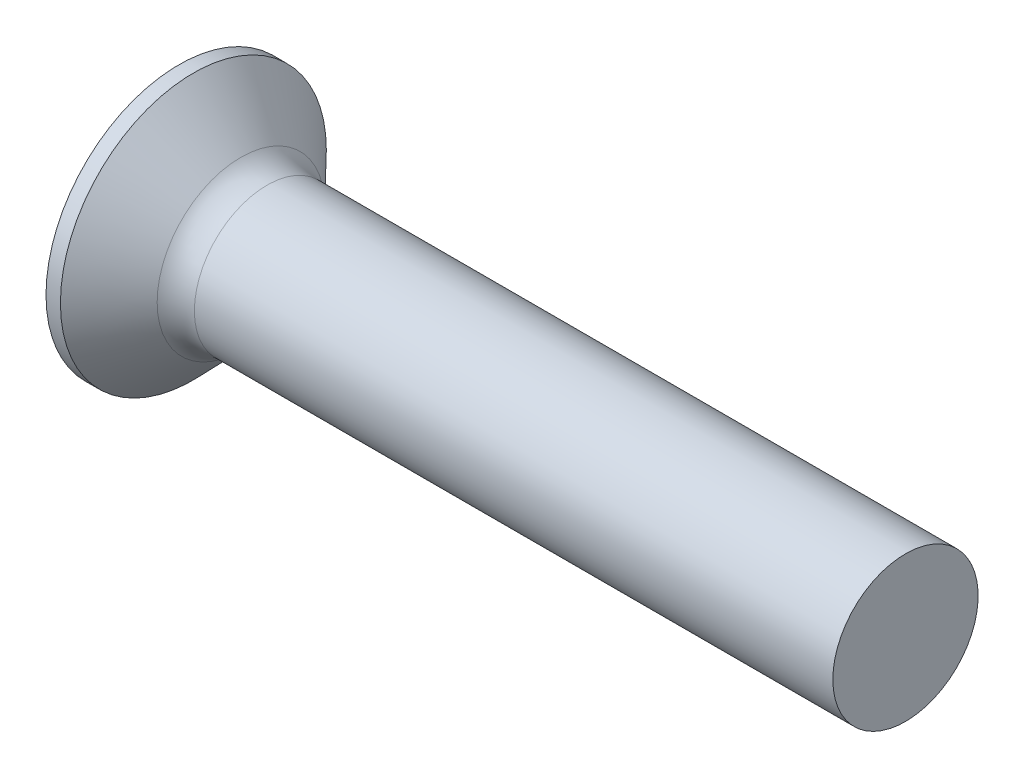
ISO-10303-21;
HEADER;
FILE_DESCRIPTION(('STEP AP214'),'2;1');
FILE_NAME('part.step','',(''),(''),'','','');
FILE_SCHEMA(('AUTOMOTIVE_DESIGN { 1 0 10303 214 1 1 1 1 }'));
ENDSEC;
DATA;
#1=APPLICATION_CONTEXT('core data for automotive mechanical design processes');
#2=APPLICATION_PROTOCOL_DEFINITION('international standard','automotive_design',2000,#1);
#3=PRODUCT_CONTEXT('',#1,'mechanical');
#4=PRODUCT('Part','Part','',(#3));
#5=PRODUCT_RELATED_PRODUCT_CATEGORY('part','',(#4));
#6=PRODUCT_DEFINITION_FORMATION('','',#4);
#7=PRODUCT_DEFINITION_CONTEXT('part definition',#1,'design');
#8=PRODUCT_DEFINITION('design','',#6,#7);
#9=PRODUCT_DEFINITION_SHAPE('','',#8);
#10=(LENGTH_UNIT() NAMED_UNIT(*) SI_UNIT(.MILLI.,.METRE.));
#11=(NAMED_UNIT(*) PLANE_ANGLE_UNIT() SI_UNIT($,.RADIAN.));
#12=(NAMED_UNIT(*) SI_UNIT($,.STERADIAN.) SOLID_ANGLE_UNIT());
#13=UNCERTAINTY_MEASURE_WITH_UNIT(LENGTH_MEASURE(1.E-05),#10,'distance_accuracy_value','');
#14=(GEOMETRIC_REPRESENTATION_CONTEXT(3) GLOBAL_UNCERTAINTY_ASSIGNED_CONTEXT((#13)) GLOBAL_UNIT_ASSIGNED_CONTEXT((#10,
#11,#12)) REPRESENTATION_CONTEXT('',''));
#15=CARTESIAN_POINT('',(0.,0.,0.));
#16=DIRECTION('',(0.,0.,1.));
#17=DIRECTION('',(1.,0.,0.));
#18=AXIS2_PLACEMENT_3D('',#15,#16,#17);
#19=CARTESIAN_POINT('',(19.3505434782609,0.,0.));
#20=DIRECTION('',(-1.,0.,0.));
#21=DIRECTION('',(0.,-1.,0.));
#22=AXIS2_PLACEMENT_3D('',#19,#20,#21);
#23=SPHERICAL_SURFACE('',#22,19.3505434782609);
#24=CARTESIAN_POINT('',(2.3,0.,0.));
#25=DIRECTION('',(-1.,0.,0.));
#26=DIRECTION('',(0.,0.,1.));
#27=AXIS2_PLACEMENT_3D('',#24,#25,#26);
#28=CIRCLE('',#27,9.15);
#29=CARTESIAN_POINT('',(2.3,0.,9.15));
#30=VERTEX_POINT('',#29);
#31=EDGE_CURVE('E212',#30,#30,#28,.T.);
#32=ORIENTED_EDGE('',*,*,#31,.T.);
#33=EDGE_LOOP('',(#32));
#34=FACE_BOUND('',#33,.T.);
#35=CARTESIAN_POINT('',(19.3505434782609,1.08,0.));
#36=DIRECTION('',(0.,-1.,0.));
#37=DIRECTION('',(0.,0.,-1.));
#38=AXIS2_PLACEMENT_3D('',#35,#36,#37);
#39=CIRCLE('',#38,19.3203812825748);
#40=CARTESIAN_POINT('',(0.643432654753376,1.08000000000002,-4.82919636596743));
#41=VERTEX_POINT('',#40);
#42=CARTESIAN_POINT('',(0.142443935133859,1.08000000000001,-2.07991462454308));
#43=VERTEX_POINT('',#42);
#44=EDGE_CURVE('E293',#41,#43,#39,.F.);
#45=ORIENTED_EDGE('',*,*,#44,.T.);
#46=CARTESIAN_POINT('',(0.142443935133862,0.,0.));
#47=DIRECTION('',(1.,0.,0.));
#48=DIRECTION('',(0.,0.,-1.));
#49=AXIS2_PLACEMENT_3D('',#46,#47,#48);
#50=CIRCLE('',#49,2.34359656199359);
#51=CARTESIAN_POINT('',(0.142443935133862,2.07991462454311,-1.08));
#52=VERTEX_POINT('',#51);
#53=EDGE_CURVE('E322',#43,#52,#50,.T.);
#54=ORIENTED_EDGE('',*,*,#53,.T.);
#55=CARTESIAN_POINT('',(19.3505434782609,0.,-1.08));
#56=DIRECTION('',(0.,0.,1.));
#57=DIRECTION('',(0.,-1.,0.));
#58=AXIS2_PLACEMENT_3D('',#55,#56,#57);
#59=CIRCLE('',#58,19.3203812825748);
#60=CARTESIAN_POINT('',(0.643432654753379,4.82919636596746,-1.08));
#61=VERTEX_POINT('',#60);
#62=EDGE_CURVE('E234',#52,#61,#59,.F.);
#63=ORIENTED_EDGE('',*,*,#62,.T.);
#64=CARTESIAN_POINT('',(17.5544828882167,-3.60234084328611,0.));
#65=DIRECTION('',(0.446197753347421,0.89493439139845,0.));
#66=DIRECTION('',(-0.89493439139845,0.446197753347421,0.));
#67=AXIS2_PLACEMENT_3D('',#64,#65,#66);
#68=CIRCLE('',#67,18.9272512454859);
#69=CARTESIAN_POINT('',(0.643432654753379,4.82919636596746,1.08));
#70=VERTEX_POINT('',#69);
#71=EDGE_CURVE('E238',#70,#61,#68,.F.);
#72=ORIENTED_EDGE('',*,*,#71,.F.);
#73=CARTESIAN_POINT('',(19.3505434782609,0.,1.08));
#74=DIRECTION('',(0.,0.,-1.));
#75=DIRECTION('',(0.,1.,0.));
#76=AXIS2_PLACEMENT_3D('',#73,#74,#75);
#77=CIRCLE('',#76,19.3203812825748);
#78=CARTESIAN_POINT('',(0.142443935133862,2.07991462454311,1.08));
#79=VERTEX_POINT('',#78);
#80=EDGE_CURVE('E231',#70,#79,#77,.F.);
#81=ORIENTED_EDGE('',*,*,#80,.T.);
#82=CARTESIAN_POINT('',(0.142443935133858,1.07999999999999,2.07991462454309));
#83=VERTEX_POINT('',#82);
#84=EDGE_CURVE('E348',#79,#83,#50,.T.);
#85=ORIENTED_EDGE('',*,*,#84,.T.);
#86=CARTESIAN_POINT('',(0.643432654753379,1.07999999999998,4.82919636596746));
#87=VERTEX_POINT('',#86);
#88=EDGE_CURVE('E259',#83,#87,#39,.F.);
#89=ORIENTED_EDGE('',*,*,#88,.T.);
#90=CARTESIAN_POINT('',(17.5544828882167,0.,-3.60234084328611));
#91=DIRECTION('',(0.446197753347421,0.,0.89493439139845));
#92=DIRECTION('',(0.89493439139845,0.,-0.446197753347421));
#93=AXIS2_PLACEMENT_3D('',#90,#91,#92);
#94=CIRCLE('',#93,18.9272512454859);
#95=CARTESIAN_POINT('',(0.643432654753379,-1.08000000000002,4.82919636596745));
#96=VERTEX_POINT('',#95);
#97=EDGE_CURVE('E55',#96,#87,#94,.F.);
#98=ORIENTED_EDGE('',*,*,#97,.F.);
#99=CARTESIAN_POINT('',(19.3505434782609,-1.08,0.));
#100=DIRECTION('',(0.,1.,0.));
#101=DIRECTION('',(0.,0.,1.));
#102=AXIS2_PLACEMENT_3D('',#99,#100,#101);
#103=CIRCLE('',#102,19.3203812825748);
#104=CARTESIAN_POINT('',(0.142443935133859,-1.08000000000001,2.07991462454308));
#105=VERTEX_POINT('',#104);
#106=EDGE_CURVE('E262',#96,#105,#103,.F.);
#107=ORIENTED_EDGE('',*,*,#106,.T.);
#108=CARTESIAN_POINT('',(0.142443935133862,-2.07991462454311,1.08));
#109=VERTEX_POINT('',#108);
#110=EDGE_CURVE('E383',#105,#109,#50,.T.);
#111=ORIENTED_EDGE('',*,*,#110,.T.);
#112=CARTESIAN_POINT('',(0.643432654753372,-4.82919636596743,1.08));
#113=VERTEX_POINT('',#112);
#114=EDGE_CURVE('E230',#109,#113,#77,.F.);
#115=ORIENTED_EDGE('',*,*,#114,.T.);
#116=CARTESIAN_POINT('',(17.5544828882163,3.60234084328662,0.));
#117=DIRECTION('',(0.44619775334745,-0.894934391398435,0.));
#118=DIRECTION('',(0.894934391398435,0.44619775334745,0.));
#119=AXIS2_PLACEMENT_3D('',#116,#117,#118);
#120=CIRCLE('',#119,18.9272512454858);
#121=CARTESIAN_POINT('',(0.643432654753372,-4.82919636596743,-1.08));
#122=VERTEX_POINT('',#121);
#123=EDGE_CURVE('E228',#122,#113,#120,.F.);
#124=ORIENTED_EDGE('',*,*,#123,.F.);
#125=CARTESIAN_POINT('',(0.142443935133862,-2.07991462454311,-1.08));
#126=VERTEX_POINT('',#125);
#127=EDGE_CURVE('E235',#122,#126,#59,.F.);
#128=ORIENTED_EDGE('',*,*,#127,.T.);
#129=CARTESIAN_POINT('',(0.142443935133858,-1.07999999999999,-2.07991462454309));
#130=VERTEX_POINT('',#129);
#131=EDGE_CURVE('E343',#126,#130,#50,.T.);
#132=ORIENTED_EDGE('',*,*,#131,.T.);
#133=CARTESIAN_POINT('',(0.643432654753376,-1.07999999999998,-4.82919636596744));
#134=VERTEX_POINT('',#133);
#135=EDGE_CURVE('E264',#130,#134,#103,.F.);
#136=ORIENTED_EDGE('',*,*,#135,.T.);
#137=CARTESIAN_POINT('',(17.5544828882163,0.,3.60234084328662));
#138=DIRECTION('',(0.44619775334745,0.,-0.894934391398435));
#139=DIRECTION('',(-0.894934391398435,0.,-0.44619775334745));
#140=AXIS2_PLACEMENT_3D('',#137,#138,#139);
#141=CIRCLE('',#140,18.9272512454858);
#142=EDGE_CURVE('E241',#41,#134,#141,.F.);
#143=ORIENTED_EDGE('',*,*,#142,.F.);
#144=EDGE_LOOP('',(#45,#54,#63,#72,#81,#85,#89,#98,#107,#111,#115,#124,#128,#132,#136,#143));
#145=FACE_BOUND('',#144,.T.);
#146=ADVANCED_FACE('F41',(#34,#145),#23,.T.);
#147=CARTESIAN_POINT('',(0.,5.15,-1.08));
#148=DIRECTION('',(0.,0.,1.));
#149=DIRECTION('',(0.,-1.,0.));
#150=AXIS2_PLACEMENT_3D('',#147,#148,#149);
#151=PLANE('',#150);
#152=ORIENTED_EDGE('',*,*,#62,.F.);
#153=CARTESIAN_POINT('',(-3.44355605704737,2.35887117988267,-1.08));
#154=CARTESIAN_POINT('',(-2.7304906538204,2.30401999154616,-1.08));
#155=CARTESIAN_POINT('',(-2.01744868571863,2.24886012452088,-1.08));
#156=CARTESIAN_POINT('',(-0.591414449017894,2.13771480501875,-1.08));
#157=CARTESIAN_POINT('',(0.121577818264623,2.08172933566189,-1.08));
#158=CARTESIAN_POINT('',(1.19100520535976,1.99697742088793,-1.08));
#159=CARTESIAN_POINT('',(1.54747097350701,1.96859781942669,-1.08));
#160=CARTESIAN_POINT('',(2.26037773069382,1.9115430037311,-1.08));
#161=CARTESIAN_POINT('',(2.61681871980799,1.88286779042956,-1.08));
#162=CARTESIAN_POINT('',(3.32966606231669,1.82518005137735,-1.08));
#163=CARTESIAN_POINT('',(3.68607241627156,1.79616753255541,-1.08));
#164=CARTESIAN_POINT('',(4.39885706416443,1.73775165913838,-1.08));
#165=CARTESIAN_POINT('',(4.75523535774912,1.70834830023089,-1.08));
#166=CARTESIAN_POINT('',(5.58663589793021,1.63921941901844,-1.08));
#167=CARTESIAN_POINT('',(6.0616435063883,1.59931748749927,-1.08));
#168=CARTESIAN_POINT('',(7.01157125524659,1.5185088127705,-1.08));
#169=CARTESIAN_POINT('',(7.48649139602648,1.47760207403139,-1.08));
#170=CARTESIAN_POINT('',(8.43619415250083,1.39450876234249,-1.08));
#171=CARTESIAN_POINT('',(8.91097677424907,1.35232225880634,-1.08));
#172=CARTESIAN_POINT('',(9.86039820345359,1.26626057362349,-1.08));
#173=CARTESIAN_POINT('',(10.335037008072,1.2223853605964,-1.08));
#174=CARTESIAN_POINT('',(11.2842082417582,1.13232451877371,-1.08));
#175=CARTESIAN_POINT('',(11.7587406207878,1.0861383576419,-1.08));
#176=CARTESIAN_POINT('',(12.4702723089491,1.01434051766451,-1.08));
#177=CARTESIAN_POINT('',(12.707398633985,0.989988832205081,-1.08));
#178=CARTESIAN_POINT('',(13.1815436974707,0.940232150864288,-1.08));
#179=CARTESIAN_POINT('',(13.4185624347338,0.914827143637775,-1.08));
#180=CARTESIAN_POINT('',(13.8925107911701,0.862671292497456,-1.08));
#181=CARTESIAN_POINT('',(14.1294403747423,0.835920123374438,-1.08));
#182=CARTESIAN_POINT('',(14.6030864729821,0.78064491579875,-1.08));
#183=CARTESIAN_POINT('',(14.8398029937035,0.752120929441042,-1.08));
#184=CARTESIAN_POINT('',(15.3129751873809,0.692614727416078,-1.08));
#185=CARTESIAN_POINT('',(15.5494308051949,0.661632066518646,-1.08));
#186=CARTESIAN_POINT('',(15.903743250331,0.612390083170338,-1.08));
#187=CARTESIAN_POINT('',(16.0217913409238,0.595513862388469,-1.08));
#188=CARTESIAN_POINT('',(16.2577108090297,0.560543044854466,-1.08));
#189=CARTESIAN_POINT('',(16.3755821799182,0.54244840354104,-1.08));
#190=CARTESIAN_POINT('',(16.4933362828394,0.523597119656,-1.08));
#191=B_SPLINE_CURVE_WITH_KNOTS('',3,(#153,#154,#155,#156,#157,#158,#159,#160,#161,#162,#163,
#164,#165,#166,#167,#168,#169,#170,#171,#172,#173,#174,#175,#176,#177,#178,#179,#180,#181,#182,
#183,#184,#185,#186,#187,#188,#189,#190),.UNSPECIFIED.,.F.,.F.,(4,2,2,2,2,2,2,2,2,2,2,2,2,2,2,2,
2,2,4),(0.,2.14551628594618,4.29107649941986,5.36385745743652,6.43663503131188,7.50939060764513,
8.58215803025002,10.0121989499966,11.44223350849,12.8721906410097,14.302174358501,
15.7324890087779,16.4476075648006,17.1627338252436,17.8780336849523,18.59331253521,
19.3087212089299,19.6664605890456,20.0242130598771),.UNSPECIFIED.);
#192=CARTESIAN_POINT('',(6.05,1.60013444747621,-1.08));
#193=VERTEX_POINT('',#192);
#194=EDGE_CURVE('E370',#52,#193,#191,.T.);
#195=ORIENTED_EDGE('',*,*,#194,.T.);
#196=DIRECTION('',(0.,1.,0.));
#197=VECTOR('',#196,1.);
#198=CARTESIAN_POINT('',(6.05,-2.13358177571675,-1.08));
#199=LINE('',#198,#197);
#200=CARTESIAN_POINT('',(6.05,2.133581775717,-1.08));
#201=VERTEX_POINT('',#200);
#202=EDGE_CURVE('E313',#193,#201,#199,.T.);
#203=ORIENTED_EDGE('',*,*,#202,.T.);
#204=DIRECTION('',(0.89493439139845,-0.446197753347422,0.));
#205=VECTOR('',#204,1.);
#206=CARTESIAN_POINT('',(0.,5.15,-1.08));
#207=LINE('',#206,#205);
#208=EDGE_CURVE('E209',#61,#201,#207,.T.);
#209=ORIENTED_EDGE('',*,*,#208,.F.);
#210=EDGE_LOOP('',(#152,#195,#203,#209));
#211=FACE_BOUND('',#210,.T.);
#212=ADVANCED_FACE('F176',(#211),#151,.T.);
#213=CARTESIAN_POINT('',(6.05,-2.13358177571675,-1.08));
#214=VERTEX_POINT('',#213);
#215=CARTESIAN_POINT('',(6.05,-1.60013444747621,-1.08));
#216=VERTEX_POINT('',#215);
#217=EDGE_CURVE('E218',#214,#216,#199,.T.);
#218=ORIENTED_EDGE('',*,*,#217,.T.);
#219=CARTESIAN_POINT('',(-3.44355604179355,-2.35887117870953,-1.08));
#220=CARTESIAN_POINT('',(-2.73049064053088,-2.30401999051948,-1.08));
#221=CARTESIAN_POINT('',(-2.01744867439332,-2.24886012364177,-1.08));
#222=CARTESIAN_POINT('',(-0.591414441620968,-2.13771480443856,-1.08));
#223=CARTESIAN_POINT('',(0.121577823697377,-2.08172933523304,-1.08));
#224=CARTESIAN_POINT('',(1.19100520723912,-1.99697742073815,-1.08));
#225=CARTESIAN_POINT('',(1.54747097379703,-1.96859781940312,-1.08));
#226=CARTESIAN_POINT('',(2.26037772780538,-1.91154300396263,-1.08));
#227=CARTESIAN_POINT('',(2.61681871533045,-1.88286779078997,-1.08));
#228=CARTESIAN_POINT('',(3.32966605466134,-1.8251800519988,-1.08));
#229=CARTESIAN_POINT('',(3.6860724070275,-1.79616753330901,-1.08));
#230=CARTESIAN_POINT('',(4.39885705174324,-1.73775166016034,-1.08));
#231=CARTESIAN_POINT('',(4.7552353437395,-1.70834830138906,-1.08));
#232=CARTESIAN_POINT('',(5.58663588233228,-1.63921942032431,-1.08));
#233=CARTESIAN_POINT('',(6.06164349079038,-1.59931748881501,-1.08));
#234=CARTESIAN_POINT('',(7.01157123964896,-1.51850881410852,-1.08));
#235=CARTESIAN_POINT('',(7.48649138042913,-1.47760207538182,-1.08));
#236=CARTESIAN_POINT('',(8.43619413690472,-1.39450876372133,-1.08));
#237=CARTESIAN_POINT('',(8.91097675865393,-1.35232226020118,-1.08));
#238=CARTESIAN_POINT('',(9.86039818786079,-1.26626057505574,-1.08));
#239=CARTESIAN_POINT('',(10.3350369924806,-1.22238536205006,-1.08));
#240=CARTESIAN_POINT('',(11.2842082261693,-1.13232452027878,-1.08));
#241=CARTESIAN_POINT('',(11.7587406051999,-1.08613835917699,-1.08));
#242=CARTESIAN_POINT('',(12.4702722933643,-1.01434051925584,-1.08));
#243=CARTESIAN_POINT('',(12.7073986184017,-0.989988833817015,-1.08));
#244=CARTESIAN_POINT('',(13.1815436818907,-0.940232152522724,-1.08));
#245=CARTESIAN_POINT('',(13.4185624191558,-0.914827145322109,-1.08));
#246=CARTESIAN_POINT('',(13.8925107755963,-0.862671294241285,-1.08));
#247=CARTESIAN_POINT('',(14.1294403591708,-0.83592012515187,-1.08));
#248=CARTESIAN_POINT('',(14.6030864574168,-0.780644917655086,-1.08));
#249=CARTESIAN_POINT('',(14.8398029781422,-0.752120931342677,-1.08));
#250=CARTESIAN_POINT('',(15.3129751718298,-0.692614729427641,-1.08));
#251=CARTESIAN_POINT('',(15.54943078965,-0.661632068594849,-1.08));
#252=CARTESIAN_POINT('',(15.9037432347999,-0.612390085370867,-1.08));
#253=CARTESIAN_POINT('',(16.021791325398,-0.595513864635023,-1.08));
#254=CARTESIAN_POINT('',(16.2577107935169,-0.56054304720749,-1.08));
#255=CARTESIAN_POINT('',(16.3755821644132,-0.542448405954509,-1.08));
#256=CARTESIAN_POINT('',(16.4933362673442,-0.523597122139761,-1.08));
#257=B_SPLINE_CURVE_WITH_KNOTS('',3,(#219,#220,#221,#222,#223,#224,#225,#226,#227,#228,#229,
#230,#231,#232,#233,#234,#235,#236,#237,#238,#239,#240,#241,#242,#243,#244,#245,#246,#247,#248,
#249,#250,#251,#252,#253,#254,#255,#256),.UNSPECIFIED.,.F.,.F.,(4,2,2,2,2,2,2,2,2,2,2,2,2,2,2,2,
2,2,4),(0.,2.14551628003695,4.29107648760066,5.36385744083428,6.43663500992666,7.50939058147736,
8.58215799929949,10.0121989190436,11.4422334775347,12.872190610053,14.3021743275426,
15.732488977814,16.4476075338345,17.1627337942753,17.8780336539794,18.5933125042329,
19.3087211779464,19.6664605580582,20.0242130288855),.UNSPECIFIED.);
#258=EDGE_CURVE('E347',#216,#126,#257,.F.);
#259=ORIENTED_EDGE('',*,*,#258,.T.);
#260=ORIENTED_EDGE('',*,*,#127,.F.);
#261=DIRECTION('',(0.894934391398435,0.44619775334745,0.));
#262=VECTOR('',#261,1.);
#263=CARTESIAN_POINT('',(0.,-5.15,-1.08));
#264=LINE('',#263,#262);
#265=EDGE_CURVE('E70',#122,#214,#264,.T.);
#266=ORIENTED_EDGE('',*,*,#265,.T.);
#267=EDGE_LOOP('',(#218,#259,#260,#266));
#268=FACE_BOUND('',#267,.T.);
#269=ADVANCED_FACE('F183',(#268),#151,.T.);
#270=CARTESIAN_POINT('',(0.,-5.15,1.08));
#271=DIRECTION('',(0.,0.,-1.));
#272=DIRECTION('',(0.,1.,0.));
#273=AXIS2_PLACEMENT_3D('',#270,#271,#272);
#274=PLANE('',#273);
#275=DIRECTION('',(0.,-1.,0.));
#276=VECTOR('',#275,1.);
#277=CARTESIAN_POINT('',(6.05,2.133581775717,1.08));
#278=LINE('',#277,#276);
#279=CARTESIAN_POINT('',(6.05,2.133581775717,1.08));
#280=VERTEX_POINT('',#279);
#281=CARTESIAN_POINT('',(6.05,1.60013444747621,1.08));
#282=VERTEX_POINT('',#281);
#283=EDGE_CURVE('E303',#280,#282,#278,.T.);
#284=ORIENTED_EDGE('',*,*,#283,.T.);
#285=CARTESIAN_POINT('',(-3.44355604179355,2.35887117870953,1.08));
#286=CARTESIAN_POINT('',(-2.73049064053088,2.30401999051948,1.08));
#287=CARTESIAN_POINT('',(-2.01744867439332,2.24886012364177,1.08));
#288=CARTESIAN_POINT('',(-0.591414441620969,2.13771480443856,1.08));
#289=CARTESIAN_POINT('',(0.121577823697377,2.08172933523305,1.08));
#290=CARTESIAN_POINT('',(1.19100520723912,1.99697742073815,1.08));
#291=CARTESIAN_POINT('',(1.54747097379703,1.96859781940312,1.08));
#292=CARTESIAN_POINT('',(2.26037772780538,1.91154300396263,1.08));
#293=CARTESIAN_POINT('',(2.61681871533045,1.88286779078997,1.08));
#294=CARTESIAN_POINT('',(3.32966605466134,1.8251800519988,1.08));
#295=CARTESIAN_POINT('',(3.6860724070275,1.79616753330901,1.08));
#296=CARTESIAN_POINT('',(4.39885705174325,1.73775166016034,1.08));
#297=CARTESIAN_POINT('',(4.7552353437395,1.70834830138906,1.08));
#298=CARTESIAN_POINT('',(5.58663588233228,1.63921942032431,1.08));
#299=CARTESIAN_POINT('',(6.06164349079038,1.59931748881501,1.08));
#300=CARTESIAN_POINT('',(7.01157123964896,1.51850881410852,1.08));
#301=CARTESIAN_POINT('',(7.48649138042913,1.47760207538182,1.08));
#302=CARTESIAN_POINT('',(8.43619413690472,1.39450876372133,1.08));
#303=CARTESIAN_POINT('',(8.91097675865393,1.35232226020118,1.08));
#304=CARTESIAN_POINT('',(9.86039818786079,1.26626057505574,1.08));
#305=CARTESIAN_POINT('',(10.3350369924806,1.22238536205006,1.08));
#306=CARTESIAN_POINT('',(11.2842082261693,1.13232452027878,1.08));
#307=CARTESIAN_POINT('',(11.7587406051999,1.08613835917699,1.08));
#308=CARTESIAN_POINT('',(12.4702722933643,1.01434051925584,1.08));
#309=CARTESIAN_POINT('',(12.7073986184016,0.989988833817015,1.08));
#310=CARTESIAN_POINT('',(13.1815436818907,0.940232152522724,1.08));
#311=CARTESIAN_POINT('',(13.4185624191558,0.914827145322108,1.08));
#312=CARTESIAN_POINT('',(13.8925107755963,0.862671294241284,1.08));
#313=CARTESIAN_POINT('',(14.1294403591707,0.83592012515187,1.08));
#314=CARTESIAN_POINT('',(14.6030864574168,0.780644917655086,1.08));
#315=CARTESIAN_POINT('',(14.8398029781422,0.752120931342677,1.08));
#316=CARTESIAN_POINT('',(15.3129751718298,0.69261472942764,1.08));
#317=CARTESIAN_POINT('',(15.54943078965,0.661632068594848,1.08));
#318=CARTESIAN_POINT('',(15.9037432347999,0.612390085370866,1.08));
#319=CARTESIAN_POINT('',(16.021791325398,0.595513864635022,1.08));
#320=CARTESIAN_POINT('',(16.2577107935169,0.560543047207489,1.08));
#321=CARTESIAN_POINT('',(16.3755821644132,0.542448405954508,1.08));
#322=CARTESIAN_POINT('',(16.4933362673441,0.523597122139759,1.08));
#323=B_SPLINE_CURVE_WITH_KNOTS('',3,(#285,#286,#287,#288,#289,#290,#291,#292,#293,#294,#295,
#296,#297,#298,#299,#300,#301,#302,#303,#304,#305,#306,#307,#308,#309,#310,#311,#312,#313,#314,
#315,#316,#317,#318,#319,#320,#321,#322),.UNSPECIFIED.,.F.,.F.,(4,2,2,2,2,2,2,2,2,2,2,2,2,2,2,2,
2,2,4),(0.,2.14551628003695,4.29107648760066,5.36385744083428,6.43663500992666,7.50939058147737,
8.58215799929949,10.0121989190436,11.4422334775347,12.872190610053,14.3021743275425,
15.732488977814,16.4476075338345,17.1627337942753,17.8780336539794,18.5933125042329,
19.3087211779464,19.6664605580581,20.0242130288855),.UNSPECIFIED.);
#324=EDGE_CURVE('E269',#282,#79,#323,.F.);
#325=ORIENTED_EDGE('',*,*,#324,.T.);
#326=ORIENTED_EDGE('',*,*,#80,.F.);
#327=DIRECTION('',(0.89493439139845,-0.446197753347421,0.));
#328=VECTOR('',#327,1.);
#329=CARTESIAN_POINT('',(0.,5.15,1.08));
#330=LINE('',#329,#328);
#331=EDGE_CURVE('E215',#70,#280,#330,.T.);
#332=ORIENTED_EDGE('',*,*,#331,.T.);
#333=EDGE_LOOP('',(#284,#325,#326,#332));
#334=FACE_BOUND('',#333,.T.);
#335=ADVANCED_FACE('F366',(#334),#274,.T.);
#336=ORIENTED_EDGE('',*,*,#114,.F.);
#337=CARTESIAN_POINT('',(-3.44355604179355,-2.35887117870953,1.08));
#338=CARTESIAN_POINT('',(-2.73049064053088,-2.30401999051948,1.08));
#339=CARTESIAN_POINT('',(-2.01744867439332,-2.24886012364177,1.08));
#340=CARTESIAN_POINT('',(-0.591414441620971,-2.13771480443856,1.08));
#341=CARTESIAN_POINT('',(0.121577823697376,-2.08172933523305,1.08));
#342=CARTESIAN_POINT('',(1.19100520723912,-1.99697742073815,1.08));
#343=CARTESIAN_POINT('',(1.54747097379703,-1.96859781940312,1.08));
#344=CARTESIAN_POINT('',(2.26037772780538,-1.91154300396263,1.08));
#345=CARTESIAN_POINT('',(2.61681871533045,-1.88286779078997,1.08));
#346=CARTESIAN_POINT('',(3.32966605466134,-1.8251800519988,1.08));
#347=CARTESIAN_POINT('',(3.6860724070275,-1.79616753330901,1.08));
#348=CARTESIAN_POINT('',(4.39885705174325,-1.73775166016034,1.08));
#349=CARTESIAN_POINT('',(4.7552353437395,-1.70834830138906,1.08));
#350=CARTESIAN_POINT('',(5.58663588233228,-1.63921942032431,1.08));
#351=CARTESIAN_POINT('',(6.06164349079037,-1.59931748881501,1.08));
#352=CARTESIAN_POINT('',(7.01157123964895,-1.51850881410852,1.08));
#353=CARTESIAN_POINT('',(7.48649138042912,-1.47760207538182,1.08));
#354=CARTESIAN_POINT('',(8.43619413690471,-1.39450876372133,1.08));
#355=CARTESIAN_POINT('',(8.91097675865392,-1.35232226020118,1.08));
#356=CARTESIAN_POINT('',(9.86039818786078,-1.26626057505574,1.08));
#357=CARTESIAN_POINT('',(10.3350369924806,-1.22238536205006,1.08));
#358=CARTESIAN_POINT('',(11.2842082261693,-1.13232452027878,1.08));
#359=CARTESIAN_POINT('',(11.7587406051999,-1.08613835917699,1.08));
#360=CARTESIAN_POINT('',(12.4702722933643,-1.01434051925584,1.08));
#361=CARTESIAN_POINT('',(12.7073986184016,-0.989988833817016,1.08));
#362=CARTESIAN_POINT('',(13.1815436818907,-0.940232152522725,1.08));
#363=CARTESIAN_POINT('',(13.4185624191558,-0.914827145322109,1.08));
#364=CARTESIAN_POINT('',(13.8925107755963,-0.862671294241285,1.08));
#365=CARTESIAN_POINT('',(14.1294403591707,-0.835920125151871,1.08));
#366=CARTESIAN_POINT('',(14.6030864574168,-0.780644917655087,1.08));
#367=CARTESIAN_POINT('',(14.8398029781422,-0.752120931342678,1.08));
#368=CARTESIAN_POINT('',(15.3129751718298,-0.692614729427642,1.08));
#369=CARTESIAN_POINT('',(15.54943078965,-0.66163206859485,1.08));
#370=CARTESIAN_POINT('',(15.9037432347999,-0.612390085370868,1.08));
#371=CARTESIAN_POINT('',(16.021791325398,-0.595513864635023,1.08));
#372=CARTESIAN_POINT('',(16.2577107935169,-0.56054304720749,1.08));
#373=CARTESIAN_POINT('',(16.3755821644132,-0.542448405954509,1.08));
#374=CARTESIAN_POINT('',(16.4933362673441,-0.52359712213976,1.08));
#375=B_SPLINE_CURVE_WITH_KNOTS('',3,(#337,#338,#339,#340,#341,#342,#343,#344,#345,#346,#347,
#348,#349,#350,#351,#352,#353,#354,#355,#356,#357,#358,#359,#360,#361,#362,#363,#364,#365,#366,
#367,#368,#369,#370,#371,#372,#373,#374),.UNSPECIFIED.,.F.,.F.,(4,2,2,2,2,2,2,2,2,2,2,2,2,2,2,2,
2,2,4),(0.,2.14551628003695,4.29107648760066,5.36385744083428,6.43663500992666,7.50939058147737,
8.58215799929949,10.0121989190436,11.4422334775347,12.872190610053,14.3021743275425,
15.732488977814,16.4476075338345,17.1627337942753,17.8780336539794,18.5933125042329,
19.3087211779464,19.6664605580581,20.0242130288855),.UNSPECIFIED.);
#376=CARTESIAN_POINT('',(6.05,-1.60013444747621,1.08));
#377=VERTEX_POINT('',#376);
#378=EDGE_CURVE('E384',#109,#377,#375,.T.);
#379=ORIENTED_EDGE('',*,*,#378,.T.);
#380=CARTESIAN_POINT('',(6.05,-2.13358177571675,1.08));
#381=VERTEX_POINT('',#380);
#382=EDGE_CURVE('E305',#377,#381,#278,.T.);
#383=ORIENTED_EDGE('',*,*,#382,.T.);
#384=DIRECTION('',(0.894934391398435,0.44619775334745,0.));
#385=VECTOR('',#384,1.);
#386=CARTESIAN_POINT('',(0.,-5.15,1.08));
#387=LINE('',#386,#385);
#388=EDGE_CURVE('E297',#113,#381,#387,.T.);
#389=ORIENTED_EDGE('',*,*,#388,.F.);
#390=EDGE_LOOP('',(#336,#379,#383,#389));
#391=FACE_BOUND('',#390,.T.);
#392=ADVANCED_FACE('F511',(#391),#274,.T.);
#393=CARTESIAN_POINT('',(6.05,2.133581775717,-1.08));
#394=DIRECTION('',(-1.,0.,0.));
#395=DIRECTION('',(0.,0.,1.));
#396=AXIS2_PLACEMENT_3D('',#393,#394,#395);
#397=PLANE('',#396);
#398=ORIENTED_EDGE('',*,*,#382,.F.);
#399=CARTESIAN_POINT('',(6.05,0.,0.));
#400=DIRECTION('',(-1.,0.,0.));
#401=DIRECTION('',(0.,0.,1.));
#402=AXIS2_PLACEMENT_3D('',#399,#400,#401);
#403=CIRCLE('',#402,1.9305);
#404=EDGE_CURVE('E340',#216,#377,#403,.T.);
#405=ORIENTED_EDGE('',*,*,#404,.F.);
#406=ORIENTED_EDGE('',*,*,#217,.F.);
#407=DIRECTION('',(0.,0.,1.));
#408=VECTOR('',#407,1.);
#409=CARTESIAN_POINT('',(6.05,-2.13358177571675,-1.08));
#410=LINE('',#409,#408);
#411=EDGE_CURVE('E300',#214,#381,#410,.T.);
#412=ORIENTED_EDGE('',*,*,#411,.T.);
#413=EDGE_LOOP('',(#398,#405,#406,#412));
#414=FACE_BOUND('',#413,.T.);
#415=ADVANCED_FACE('F413',(#414),#397,.T.);
#416=DIRECTION('',(0.,0.,-1.));
#417=VECTOR('',#416,1.);
#418=CARTESIAN_POINT('',(6.05,-1.08000000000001,2.133581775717));
#419=LINE('',#418,#417);
#420=CARTESIAN_POINT('',(6.05,-1.07999999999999,-1.60013444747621));
#421=VERTEX_POINT('',#420);
#422=CARTESIAN_POINT('',(6.05,-1.07999999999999,-2.13358177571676));
#423=VERTEX_POINT('',#422);
#424=EDGE_CURVE('E287',#421,#423,#419,.T.);
#425=ORIENTED_EDGE('',*,*,#424,.F.);
#426=CARTESIAN_POINT('',(6.05,1.08000000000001,-1.60013444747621));
#427=VERTEX_POINT('',#426);
#428=EDGE_CURVE('E62',#427,#421,#403,.T.);
#429=ORIENTED_EDGE('',*,*,#428,.F.);
#430=DIRECTION('',(0.,0.,1.));
#431=VECTOR('',#430,1.);
#432=CARTESIAN_POINT('',(6.05,1.08000000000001,-2.13358177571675));
#433=LINE('',#432,#431);
#434=CARTESIAN_POINT('',(6.05,1.08000000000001,-2.13358177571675));
#435=VERTEX_POINT('',#434);
#436=EDGE_CURVE('E290',#435,#427,#433,.T.);
#437=ORIENTED_EDGE('',*,*,#436,.F.);
#438=DIRECTION('',(0.,-1.,0.));
#439=VECTOR('',#438,1.);
#440=CARTESIAN_POINT('',(6.05,1.08000000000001,-2.13358177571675));
#441=LINE('',#440,#439);
#442=EDGE_CURVE('E281',#435,#423,#441,.T.);
#443=ORIENTED_EDGE('',*,*,#442,.T.);
#444=EDGE_LOOP('',(#425,#429,#437,#443));
#445=FACE_BOUND('',#444,.T.);
#446=ADVANCED_FACE('F335',(#445),#397,.T.);
#447=ORIENTED_EDGE('',*,*,#202,.F.);
#448=EDGE_CURVE('E339',#282,#193,#403,.T.);
#449=ORIENTED_EDGE('',*,*,#448,.F.);
#450=ORIENTED_EDGE('',*,*,#283,.F.);
#451=DIRECTION('',(0.,0.,-1.));
#452=VECTOR('',#451,1.);
#453=CARTESIAN_POINT('',(6.05,2.133581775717,1.08));
#454=LINE('',#453,#452);
#455=EDGE_CURVE('E306',#280,#201,#454,.T.);
#456=ORIENTED_EDGE('',*,*,#455,.T.);
#457=EDGE_LOOP('',(#447,#449,#450,#456));
#458=FACE_BOUND('',#457,.T.);
#459=ADVANCED_FACE('F414',(#458),#397,.T.);
#460=CARTESIAN_POINT('',(0.,1.07999999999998,5.15));
#461=DIRECTION('',(0.,-1.,0.));
#462=DIRECTION('',(0.,0.,-1.));
#463=AXIS2_PLACEMENT_3D('',#460,#461,#462);
#464=PLANE('',#463);
#465=ORIENTED_EDGE('',*,*,#88,.F.);
#466=CARTESIAN_POINT('',(-3.44355605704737,1.07999999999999,2.35887117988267));
#467=CARTESIAN_POINT('',(-2.7304906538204,1.07999999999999,2.30401999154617));
#468=CARTESIAN_POINT('',(-2.01744868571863,1.07999999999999,2.24886012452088));
#469=CARTESIAN_POINT('',(-0.591414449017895,1.07999999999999,2.13771480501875));
#470=CARTESIAN_POINT('',(0.121577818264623,1.07999999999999,2.0817293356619));
#471=CARTESIAN_POINT('',(1.19100520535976,1.07999999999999,1.99697742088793));
#472=CARTESIAN_POINT('',(1.54747097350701,1.07999999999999,1.9685978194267));
#473=CARTESIAN_POINT('',(2.26037773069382,1.07999999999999,1.91154300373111));
#474=CARTESIAN_POINT('',(2.616818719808,1.07999999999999,1.88286779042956));
#475=CARTESIAN_POINT('',(3.32966606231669,1.07999999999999,1.82518005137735));
#476=CARTESIAN_POINT('',(3.68607241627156,1.07999999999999,1.79616753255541));
#477=CARTESIAN_POINT('',(4.39885706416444,1.07999999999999,1.73775165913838));
#478=CARTESIAN_POINT('',(4.75523535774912,1.07999999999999,1.7083483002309));
#479=CARTESIAN_POINT('',(5.58663589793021,1.07999999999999,1.63921941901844));
#480=CARTESIAN_POINT('',(6.0616435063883,1.07999999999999,1.59931748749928));
#481=CARTESIAN_POINT('',(7.01157125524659,1.07999999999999,1.5185088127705));
#482=CARTESIAN_POINT('',(7.48649139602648,1.07999999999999,1.47760207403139));
#483=CARTESIAN_POINT('',(8.43619415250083,1.08,1.39450876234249));
#484=CARTESIAN_POINT('',(8.91097677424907,1.08,1.35232225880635));
#485=CARTESIAN_POINT('',(9.86039820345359,1.08,1.2662605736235));
#486=CARTESIAN_POINT('',(10.335037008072,1.08,1.2223853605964));
#487=CARTESIAN_POINT('',(11.2842082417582,1.08,1.13232451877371));
#488=CARTESIAN_POINT('',(11.7587406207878,1.08,1.08613835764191));
#489=CARTESIAN_POINT('',(12.4702723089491,1.08,1.01434051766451));
#490=CARTESIAN_POINT('',(12.707398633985,1.08,0.989988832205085));
#491=CARTESIAN_POINT('',(13.1815436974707,1.08,0.940232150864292));
#492=CARTESIAN_POINT('',(13.4185624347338,1.08,0.914827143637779));
#493=CARTESIAN_POINT('',(13.8925107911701,1.08,0.86267129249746));
#494=CARTESIAN_POINT('',(14.1294403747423,1.08,0.835920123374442));
#495=CARTESIAN_POINT('',(14.6030864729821,1.08,0.780644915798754));
#496=CARTESIAN_POINT('',(14.8398029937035,1.08,0.752120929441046));
#497=CARTESIAN_POINT('',(15.3129751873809,1.08,0.692614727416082));
#498=CARTESIAN_POINT('',(15.5494308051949,1.08,0.66163206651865));
#499=CARTESIAN_POINT('',(15.903743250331,1.08,0.612390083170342));
#500=CARTESIAN_POINT('',(16.0217913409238,1.08,0.595513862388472));
#501=CARTESIAN_POINT('',(16.2577108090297,1.08,0.56054304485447));
#502=CARTESIAN_POINT('',(16.3755821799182,1.08,0.542448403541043));
#503=CARTESIAN_POINT('',(16.4933362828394,1.08,0.523597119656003));
#504=B_SPLINE_CURVE_WITH_KNOTS('',3,(#466,#467,#468,#469,#470,#471,#472,#473,#474,#475,#476,
#477,#478,#479,#480,#481,#482,#483,#484,#485,#486,#487,#488,#489,#490,#491,#492,#493,#494,#495,
#496,#497,#498,#499,#500,#501,#502,#503),.UNSPECIFIED.,.F.,.F.,(4,2,2,2,2,2,2,2,2,2,2,2,2,2,2,2,
2,2,4),(0.,2.14551628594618,4.29107649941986,5.36385745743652,6.43663503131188,7.50939060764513,
8.58215803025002,10.0121989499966,11.44223350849,12.8721906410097,14.302174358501,
15.7324890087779,16.4476075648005,17.1627338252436,17.8780336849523,18.59331253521,
19.3087212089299,19.6664605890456,20.0242130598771),.UNSPECIFIED.);
#505=CARTESIAN_POINT('',(6.05,1.07999999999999,1.60013444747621));
#506=VERTEX_POINT('',#505);
#507=EDGE_CURVE('E584',#83,#506,#504,.T.);
#508=ORIENTED_EDGE('',*,*,#507,.T.);
#509=CARTESIAN_POINT('',(6.05,1.07999999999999,2.133581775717));
#510=VERTEX_POINT('',#509);
#511=EDGE_CURVE('E261',#506,#510,#433,.T.);
#512=ORIENTED_EDGE('',*,*,#511,.T.);
#513=DIRECTION('',(0.89493439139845,0.,-0.446197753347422));
#514=VECTOR('',#513,1.);
#515=CARTESIAN_POINT('',(0.,1.07999999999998,5.15));
#516=LINE('',#515,#514);
#517=EDGE_CURVE('E251',#87,#510,#516,.T.);
#518=ORIENTED_EDGE('',*,*,#517,.F.);
#519=EDGE_LOOP('',(#465,#508,#512,#518));
#520=FACE_BOUND('',#519,.T.);
#521=ADVANCED_FACE('F257',(#520),#464,.T.);
#522=CARTESIAN_POINT('',(0.,-1.07999999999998,-5.15));
#523=DIRECTION('',(0.,1.,0.));
#524=DIRECTION('',(0.,0.,1.));
#525=AXIS2_PLACEMENT_3D('',#522,#523,#524);
#526=PLANE('',#525);
#527=CARTESIAN_POINT('',(6.05,-1.08000000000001,2.133581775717));
#528=VERTEX_POINT('',#527);
#529=CARTESIAN_POINT('',(6.05,-1.08000000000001,1.60013444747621));
#530=VERTEX_POINT('',#529);
#531=EDGE_CURVE('E284',#528,#530,#419,.T.);
#532=ORIENTED_EDGE('',*,*,#531,.T.);
#533=CARTESIAN_POINT('',(-3.44355605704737,-1.08000000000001,2.35887117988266));
#534=CARTESIAN_POINT('',(-2.7304906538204,-1.08000000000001,2.30401999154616));
#535=CARTESIAN_POINT('',(-2.01744868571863,-1.08000000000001,2.24886012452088));
#536=CARTESIAN_POINT('',(-0.591414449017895,-1.08000000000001,2.13771480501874));
#537=CARTESIAN_POINT('',(0.121577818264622,-1.08000000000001,2.08172933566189));
#538=CARTESIAN_POINT('',(1.19100520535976,-1.08000000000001,1.99697742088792));
#539=CARTESIAN_POINT('',(1.54747097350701,-1.08000000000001,1.96859781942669));
#540=CARTESIAN_POINT('',(2.26037773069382,-1.08000000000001,1.9115430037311));
#541=CARTESIAN_POINT('',(2.616818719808,-1.08000000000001,1.88286779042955));
#542=CARTESIAN_POINT('',(3.32966606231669,-1.08000000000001,1.82518005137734));
#543=CARTESIAN_POINT('',(3.68607241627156,-1.08000000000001,1.7961675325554));
#544=CARTESIAN_POINT('',(4.39885706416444,-1.08000000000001,1.73775165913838));
#545=CARTESIAN_POINT('',(4.75523535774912,-1.08000000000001,1.70834830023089));
#546=CARTESIAN_POINT('',(5.58663589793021,-1.08000000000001,1.63921941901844));
#547=CARTESIAN_POINT('',(6.0616435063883,-1.08000000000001,1.59931748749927));
#548=CARTESIAN_POINT('',(7.01157125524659,-1.08000000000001,1.5185088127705));
#549=CARTESIAN_POINT('',(7.48649139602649,-1.08000000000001,1.47760207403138));
#550=CARTESIAN_POINT('',(8.43619415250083,-1.08000000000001,1.39450876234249));
#551=CARTESIAN_POINT('',(8.91097677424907,-1.08000000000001,1.35232225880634));
#552=CARTESIAN_POINT('',(9.86039820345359,-1.08000000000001,1.26626057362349));
#553=CARTESIAN_POINT('',(10.335037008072,-1.08,1.2223853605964));
#554=CARTESIAN_POINT('',(11.2842082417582,-1.08,1.1323245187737));
#555=CARTESIAN_POINT('',(11.7587406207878,-1.08,1.0861383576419));
#556=CARTESIAN_POINT('',(12.4702723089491,-1.08,1.0143405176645));
#557=CARTESIAN_POINT('',(12.707398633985,-1.08,0.989988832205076));
#558=CARTESIAN_POINT('',(13.1815436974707,-1.08,0.940232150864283));
#559=CARTESIAN_POINT('',(13.4185624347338,-1.08,0.91482714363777));
#560=CARTESIAN_POINT('',(13.8925107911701,-1.08,0.862671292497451));
#561=CARTESIAN_POINT('',(14.1294403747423,-1.08,0.835920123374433));
#562=CARTESIAN_POINT('',(14.6030864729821,-1.08,0.780644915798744));
#563=CARTESIAN_POINT('',(14.8398029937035,-1.08,0.752120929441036));
#564=CARTESIAN_POINT('',(15.3129751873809,-1.08,0.692614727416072));
#565=CARTESIAN_POINT('',(15.5494308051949,-1.08,0.66163206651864));
#566=CARTESIAN_POINT('',(15.903743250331,-1.08,0.612390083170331));
#567=CARTESIAN_POINT('',(16.0217913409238,-1.08,0.595513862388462));
#568=CARTESIAN_POINT('',(16.2577108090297,-1.08,0.560543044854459));
#569=CARTESIAN_POINT('',(16.3755821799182,-1.08,0.542448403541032));
#570=CARTESIAN_POINT('',(16.4933362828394,-1.08,0.523597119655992));
#571=B_SPLINE_CURVE_WITH_KNOTS('',3,(#533,#534,#535,#536,#537,#538,#539,#540,#541,#542,#543,
#544,#545,#546,#547,#548,#549,#550,#551,#552,#553,#554,#555,#556,#557,#558,#559,#560,#561,#562,
#563,#564,#565,#566,#567,#568,#569,#570),.UNSPECIFIED.,.F.,.F.,(4,2,2,2,2,2,2,2,2,2,2,2,2,2,2,2,
2,2,4),(0.,2.14551628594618,4.29107649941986,5.36385745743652,6.43663503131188,7.50939060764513,
8.58215803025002,10.0121989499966,11.44223350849,12.8721906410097,14.302174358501,
15.7324890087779,16.4476075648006,17.1627338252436,17.8780336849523,18.59331253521,
19.3087212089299,19.6664605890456,20.0242130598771),.UNSPECIFIED.);
#572=EDGE_CURVE('E376',#530,#105,#571,.F.);
#573=ORIENTED_EDGE('',*,*,#572,.T.);
#574=ORIENTED_EDGE('',*,*,#106,.F.);
#575=DIRECTION('',(0.89493439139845,0.,-0.446197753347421));
#576=VECTOR('',#575,1.);
#577=CARTESIAN_POINT('',(0.,-1.08000000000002,5.15));
#578=LINE('',#577,#576);
#579=EDGE_CURVE('E253',#96,#528,#578,.T.);
#580=ORIENTED_EDGE('',*,*,#579,.T.);
#581=EDGE_LOOP('',(#532,#573,#574,#580));
#582=FACE_BOUND('',#581,.T.);
#583=ADVANCED_FACE('F203',(#582),#526,.T.);
#584=ORIENTED_EDGE('',*,*,#436,.T.);
#585=CARTESIAN_POINT('',(-3.44355605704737,1.08000000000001,-2.35887117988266));
#586=CARTESIAN_POINT('',(-2.7304906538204,1.08000000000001,-2.30401999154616));
#587=CARTESIAN_POINT('',(-2.01744868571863,1.08000000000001,-2.24886012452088));
#588=CARTESIAN_POINT('',(-0.591414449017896,1.08000000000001,-2.13771480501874));
#589=CARTESIAN_POINT('',(0.121577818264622,1.08000000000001,-2.08172933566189));
#590=CARTESIAN_POINT('',(1.19100520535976,1.08000000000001,-1.99697742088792));
#591=CARTESIAN_POINT('',(1.54747097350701,1.08000000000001,-1.96859781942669));
#592=CARTESIAN_POINT('',(2.26037773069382,1.08000000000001,-1.9115430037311));
#593=CARTESIAN_POINT('',(2.61681871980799,1.08000000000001,-1.88286779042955));
#594=CARTESIAN_POINT('',(3.32966606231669,1.08000000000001,-1.82518005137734));
#595=CARTESIAN_POINT('',(3.68607241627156,1.08000000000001,-1.7961675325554));
#596=CARTESIAN_POINT('',(4.39885706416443,1.08000000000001,-1.73775165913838));
#597=CARTESIAN_POINT('',(4.75523535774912,1.08000000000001,-1.70834830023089));
#598=CARTESIAN_POINT('',(5.58663589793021,1.08000000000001,-1.63921941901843));
#599=CARTESIAN_POINT('',(6.06164350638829,1.08000000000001,-1.59931748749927));
#600=CARTESIAN_POINT('',(7.01157125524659,1.08000000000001,-1.5185088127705));
#601=CARTESIAN_POINT('',(7.48649139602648,1.08000000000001,-1.47760207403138));
#602=CARTESIAN_POINT('',(8.43619415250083,1.08,-1.39450876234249));
#603=CARTESIAN_POINT('',(8.91097677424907,1.08,-1.35232225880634));
#604=CARTESIAN_POINT('',(9.86039820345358,1.08,-1.26626057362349));
#605=CARTESIAN_POINT('',(10.335037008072,1.08,-1.2223853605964));
#606=CARTESIAN_POINT('',(11.2842082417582,1.08,-1.1323245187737));
#607=CARTESIAN_POINT('',(11.7587406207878,1.08,-1.0861383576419));
#608=CARTESIAN_POINT('',(12.4702723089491,1.08,-1.0143405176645));
#609=CARTESIAN_POINT('',(12.707398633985,1.08,-0.989988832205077));
#610=CARTESIAN_POINT('',(13.1815436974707,1.08,-0.940232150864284));
#611=CARTESIAN_POINT('',(13.4185624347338,1.08,-0.914827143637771));
#612=CARTESIAN_POINT('',(13.8925107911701,1.08,-0.862671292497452));
#613=CARTESIAN_POINT('',(14.1294403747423,1.08,-0.835920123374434));
#614=CARTESIAN_POINT('',(14.6030864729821,1.08,-0.780644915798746));
#615=CARTESIAN_POINT('',(14.8398029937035,1.08,-0.752120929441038));
#616=CARTESIAN_POINT('',(15.3129751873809,1.08,-0.692614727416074));
#617=CARTESIAN_POINT('',(15.5494308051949,1.08,-0.661632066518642));
#618=CARTESIAN_POINT('',(15.903743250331,1.08,-0.612390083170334));
#619=CARTESIAN_POINT('',(16.0217913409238,1.08,-0.595513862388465));
#620=CARTESIAN_POINT('',(16.2577108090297,1.08,-0.560543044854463));
#621=CARTESIAN_POINT('',(16.3755821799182,1.08,-0.542448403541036));
#622=CARTESIAN_POINT('',(16.4933362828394,1.08,-0.523597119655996));
#623=B_SPLINE_CURVE_WITH_KNOTS('',3,(#585,#586,#587,#588,#589,#590,#591,#592,#593,#594,#595,
#596,#597,#598,#599,#600,#601,#602,#603,#604,#605,#606,#607,#608,#609,#610,#611,#612,#613,#614,
#615,#616,#617,#618,#619,#620,#621,#622),.UNSPECIFIED.,.F.,.F.,(4,2,2,2,2,2,2,2,2,2,2,2,2,2,2,2,
2,2,4),(0.,2.14551628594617,4.29107649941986,5.36385745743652,6.43663503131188,7.50939060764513,
8.58215803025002,10.0121989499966,11.44223350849,12.8721906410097,14.302174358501,
15.7324890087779,16.4476075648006,17.1627338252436,17.8780336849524,18.59331253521,
19.3087212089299,19.6664605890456,20.0242130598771),.UNSPECIFIED.);
#624=EDGE_CURVE('E328',#427,#43,#623,.F.);
#625=ORIENTED_EDGE('',*,*,#624,.T.);
#626=ORIENTED_EDGE('',*,*,#44,.F.);
#627=DIRECTION('',(0.894934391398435,0.,0.44619775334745));
#628=VECTOR('',#627,1.);
#629=CARTESIAN_POINT('',(0.,1.08000000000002,-5.15));
#630=LINE('',#629,#628);
#631=EDGE_CURVE('E266',#41,#435,#630,.T.);
#632=ORIENTED_EDGE('',*,*,#631,.T.);
#633=EDGE_LOOP('',(#584,#625,#626,#632));
#634=FACE_BOUND('',#633,.T.);
#635=ADVANCED_FACE('F201',(#634),#464,.T.);
#636=ORIENTED_EDGE('',*,*,#135,.F.);
#637=CARTESIAN_POINT('',(-3.44355604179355,-1.07999999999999,-2.35887117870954));
#638=CARTESIAN_POINT('',(-2.73049064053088,-1.07999999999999,-2.30401999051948));
#639=CARTESIAN_POINT('',(-2.01744867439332,-1.07999999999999,-2.24886012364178));
#640=CARTESIAN_POINT('',(-0.59141444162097,-1.07999999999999,-2.13771480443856));
#641=CARTESIAN_POINT('',(0.121577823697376,-1.07999999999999,-2.08172933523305));
#642=CARTESIAN_POINT('',(1.19100520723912,-1.07999999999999,-1.99697742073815));
#643=CARTESIAN_POINT('',(1.54747097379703,-1.07999999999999,-1.96859781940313));
#644=CARTESIAN_POINT('',(2.26037772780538,-1.07999999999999,-1.91154300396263));
#645=CARTESIAN_POINT('',(2.61681871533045,-1.07999999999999,-1.88286779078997));
#646=CARTESIAN_POINT('',(3.32966605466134,-1.07999999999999,-1.8251800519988));
#647=CARTESIAN_POINT('',(3.68607240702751,-1.07999999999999,-1.79616753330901));
#648=CARTESIAN_POINT('',(4.39885705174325,-1.07999999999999,-1.73775166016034));
#649=CARTESIAN_POINT('',(4.7552353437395,-1.07999999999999,-1.70834830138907));
#650=CARTESIAN_POINT('',(5.58663588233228,-1.07999999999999,-1.63921942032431));
#651=CARTESIAN_POINT('',(6.06164349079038,-1.07999999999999,-1.59931748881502));
#652=CARTESIAN_POINT('',(7.01157123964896,-1.07999999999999,-1.51850881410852));
#653=CARTESIAN_POINT('',(7.48649138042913,-1.07999999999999,-1.47760207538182));
#654=CARTESIAN_POINT('',(8.43619413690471,-1.08,-1.39450876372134));
#655=CARTESIAN_POINT('',(8.91097675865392,-1.08,-1.35232226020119));
#656=CARTESIAN_POINT('',(9.86039818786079,-1.08,-1.26626057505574));
#657=CARTESIAN_POINT('',(10.3350369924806,-1.08,-1.22238536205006));
#658=CARTESIAN_POINT('',(11.2842082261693,-1.08,-1.13232452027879));
#659=CARTESIAN_POINT('',(11.7587406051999,-1.08,-1.08613835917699));
#660=CARTESIAN_POINT('',(12.4702722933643,-1.08,-1.01434051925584));
#661=CARTESIAN_POINT('',(12.7073986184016,-1.08,-0.989988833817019));
#662=CARTESIAN_POINT('',(13.1815436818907,-1.08,-0.940232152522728));
#663=CARTESIAN_POINT('',(13.4185624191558,-1.08,-0.914827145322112));
#664=CARTESIAN_POINT('',(13.8925107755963,-1.08,-0.862671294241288));
#665=CARTESIAN_POINT('',(14.1294403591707,-1.08,-0.835920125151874));
#666=CARTESIAN_POINT('',(14.6030864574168,-1.08,-0.78064491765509));
#667=CARTESIAN_POINT('',(14.8398029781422,-1.08,-0.752120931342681));
#668=CARTESIAN_POINT('',(15.3129751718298,-1.08,-0.692614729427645));
#669=CARTESIAN_POINT('',(15.54943078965,-1.08,-0.661632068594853));
#670=CARTESIAN_POINT('',(15.9037432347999,-1.08,-0.612390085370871));
#671=CARTESIAN_POINT('',(16.021791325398,-1.08,-0.595513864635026));
#672=CARTESIAN_POINT('',(16.2577107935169,-1.08,-0.560543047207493));
#673=CARTESIAN_POINT('',(16.3755821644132,-1.08,-0.542448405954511));
#674=CARTESIAN_POINT('',(16.4933362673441,-1.08,-0.523597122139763));
#675=B_SPLINE_CURVE_WITH_KNOTS('',3,(#637,#638,#639,#640,#641,#642,#643,#644,#645,#646,#647,
#648,#649,#650,#651,#652,#653,#654,#655,#656,#657,#658,#659,#660,#661,#662,#663,#664,#665,#666,
#667,#668,#669,#670,#671,#672,#673,#674),.UNSPECIFIED.,.F.,.F.,(4,2,2,2,2,2,2,2,2,2,2,2,2,2,2,2,
2,2,4),(0.,2.14551628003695,4.29107648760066,5.36385744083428,6.43663500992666,7.50939058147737,
8.58215799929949,10.0121989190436,11.4422334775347,12.872190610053,14.3021743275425,
15.732488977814,16.4476075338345,17.1627337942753,17.8780336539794,18.5933125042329,
19.3087211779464,19.6664605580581,20.0242130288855),.UNSPECIFIED.);
#676=EDGE_CURVE('E11',#130,#421,#675,.T.);
#677=ORIENTED_EDGE('',*,*,#676,.T.);
#678=ORIENTED_EDGE('',*,*,#424,.T.);
#679=DIRECTION('',(0.894934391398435,0.,0.44619775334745));
#680=VECTOR('',#679,1.);
#681=CARTESIAN_POINT('',(0.,-1.07999999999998,-5.15));
#682=LINE('',#681,#680);
#683=EDGE_CURVE('E278',#134,#423,#682,.T.);
#684=ORIENTED_EDGE('',*,*,#683,.F.);
#685=EDGE_LOOP('',(#636,#677,#678,#684));
#686=FACE_BOUND('',#685,.T.);
#687=ADVANCED_FACE('F193',(#686),#526,.T.);
#688=CARTESIAN_POINT('',(52.3,0.,0.));
#689=DIRECTION('',(-1.,0.,0.));
#690=DIRECTION('',(0.,0.,1.));
#691=AXIS2_PLACEMENT_3D('',#688,#689,#690);
#692=PLANE('',#691);
#693=CARTESIAN_POINT('',(52.3,0.,0.));
#694=DIRECTION('',(-1.,0.,0.));
#695=DIRECTION('',(0.,0.,1.));
#696=AXIS2_PLACEMENT_3D('',#693,#694,#695);
#697=CIRCLE('',#696,5.);
#698=CARTESIAN_POINT('',(52.3,0.,5.));
#699=VERTEX_POINT('',#698);
#700=EDGE_CURVE('E206',#699,#699,#697,.T.);
#701=ORIENTED_EDGE('',*,*,#700,.F.);
#702=EDGE_LOOP('',(#701));
#703=FACE_BOUND('',#702,.T.);
#704=ADVANCED_FACE('F191',(#703),#692,.F.);
#705=CARTESIAN_POINT('',(-15.875,0.,0.));
#706=DIRECTION('',(-1.,0.,0.));
#707=DIRECTION('',(0.,0.,1.));
#708=AXIS2_PLACEMENT_3D('',#705,#706,#707);
#709=CYLINDRICAL_SURFACE('',#708,9.15);
#710=ORIENTED_EDGE('',*,*,#31,.F.);
#711=EDGE_LOOP('',(#710));
#712=FACE_BOUND('',#711,.T.);
#713=CARTESIAN_POINT('',(3.29239158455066,0.,0.));
#714=DIRECTION('',(-1.,0.,0.));
#715=DIRECTION('',(0.,0.,1.));
#716=AXIS2_PLACEMENT_3D('',#713,#714,#715);
#717=CIRCLE('',#716,9.15);
#718=CARTESIAN_POINT('',(3.29239158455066,0.,9.15));
#719=VERTEX_POINT('',#718);
#720=EDGE_CURVE('E208',#719,#719,#717,.T.);
#721=ORIENTED_EDGE('',*,*,#720,.T.);
#722=EDGE_LOOP('',(#721));
#723=FACE_BOUND('',#722,.T.);
#724=ADVANCED_FACE('F189',(#712,#723),#709,.T.);
#725=CARTESIAN_POINT('',(3.29239158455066,0.,0.));
#726=DIRECTION('',(-1.,0.,0.));
#727=DIRECTION('',(0.,0.,1.));
#728=AXIS2_PLACEMENT_3D('',#725,#726,#727);
#729=CONICAL_SURFACE('',#728,9.15,0.802851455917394);
#730=CARTESIAN_POINT('',(6.56283753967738,0.,0.));
#731=DIRECTION('',(1.,0.,0.));
#732=DIRECTION('',(0.,0.,-1.));
#733=AXIS2_PLACEMENT_3D('',#730,#731,#732);
#734=CIRCLE('',#733,5.76335407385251);
#735=CARTESIAN_POINT('',(6.56283753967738,0.,-5.76335407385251));
#736=VERTEX_POINT('',#735);
#737=EDGE_CURVE('E222',#736,#736,#734,.F.);
#738=ORIENTED_EDGE('',*,*,#737,.T.);
#739=EDGE_LOOP('',(#738));
#740=FACE_BOUND('',#739,.T.);
#741=ORIENTED_EDGE('',*,*,#720,.F.);
#742=EDGE_LOOP('',(#741));
#743=FACE_BOUND('',#742,.T.);
#744=ADVANCED_FACE('F198',(#740,#743),#729,.T.);
#745=CARTESIAN_POINT('',(-15.875,0.,0.));
#746=DIRECTION('',(-1.,0.,0.));
#747=DIRECTION('',(0.,0.,1.));
#748=AXIS2_PLACEMENT_3D('',#745,#746,#747);
#749=CYLINDRICAL_SURFACE('',#748,5.);
#750=CARTESIAN_POINT('',(8.36118704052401,0.,0.));
#751=DIRECTION('',(-1.,0.,0.));
#752=DIRECTION('',(0.,0.,1.));
#753=AXIS2_PLACEMENT_3D('',#750,#751,#752);
#754=CIRCLE('',#753,5.);
#755=CARTESIAN_POINT('',(8.36118704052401,0.,5.));
#756=VERTEX_POINT('',#755);
#757=EDGE_CURVE('E225',#756,#756,#754,.F.);
#758=ORIENTED_EDGE('',*,*,#757,.T.);
#759=EDGE_LOOP('',(#758));
#760=FACE_BOUND('',#759,.T.);
#761=ORIENTED_EDGE('',*,*,#700,.T.);
#762=EDGE_LOOP('',(#761));
#763=FACE_BOUND('',#762,.T.);
#764=ADVANCED_FACE('F415',(#760,#763),#749,.T.);
#765=CARTESIAN_POINT('',(8.36118704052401,0.,0.));
#766=DIRECTION('',(-1.,0.,0.));
#767=DIRECTION('',(0.,0.,1.));
#768=AXIS2_PLACEMENT_3D('',#765,#766,#767);
#769=TOROIDAL_SURFACE('',#768,7.5,2.5);
#770=ORIENTED_EDGE('',*,*,#757,.F.);
#771=EDGE_LOOP('',(#770));
#772=FACE_BOUND('',#771,.T.);
#773=ORIENTED_EDGE('',*,*,#737,.F.);
#774=EDGE_LOOP('',(#773));
#775=FACE_BOUND('',#774,.T.);
#776=ADVANCED_FACE('F43',(#772,#775),#769,.F.);
#777=ORIENTED_EDGE('',*,*,#511,.F.);
#778=EDGE_CURVE('E344',#530,#506,#403,.T.);
#779=ORIENTED_EDGE('',*,*,#778,.F.);
#780=ORIENTED_EDGE('',*,*,#531,.F.);
#781=DIRECTION('',(0.,1.,0.));
#782=VECTOR('',#781,1.);
#783=CARTESIAN_POINT('',(6.05,-1.08000000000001,2.133581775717));
#784=LINE('',#783,#782);
#785=EDGE_CURVE('E288',#528,#510,#784,.T.);
#786=ORIENTED_EDGE('',*,*,#785,.T.);
#787=EDGE_LOOP('',(#777,#779,#780,#786));
#788=FACE_BOUND('',#787,.T.);
#789=ADVANCED_FACE('F407',(#788),#397,.T.);
#790=CARTESIAN_POINT('',(6.05,2.133581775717,1.08));
#791=DIRECTION('',(0.446197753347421,0.89493439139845,0.));
#792=DIRECTION('',(-0.89493439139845,0.446197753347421,0.));
#793=AXIS2_PLACEMENT_3D('',#790,#791,#792);
#794=PLANE('',#793);
#795=ORIENTED_EDGE('',*,*,#71,.T.);
#796=ORIENTED_EDGE('',*,*,#208,.T.);
#797=ORIENTED_EDGE('',*,*,#455,.F.);
#798=ORIENTED_EDGE('',*,*,#331,.F.);
#799=EDGE_LOOP('',(#795,#796,#797,#798));
#800=FACE_BOUND('',#799,.T.);
#801=ADVANCED_FACE('F364',(#800),#794,.F.);
#802=CARTESIAN_POINT('',(0.,-5.15,-1.08));
#803=DIRECTION('',(0.44619775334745,-0.894934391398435,0.));
#804=DIRECTION('',(0.894934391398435,0.44619775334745,0.));
#805=AXIS2_PLACEMENT_3D('',#802,#803,#804);
#806=PLANE('',#805);
#807=ORIENTED_EDGE('',*,*,#123,.T.);
#808=ORIENTED_EDGE('',*,*,#388,.T.);
#809=ORIENTED_EDGE('',*,*,#411,.F.);
#810=ORIENTED_EDGE('',*,*,#265,.F.);
#811=EDGE_LOOP('',(#807,#808,#809,#810));
#812=FACE_BOUND('',#811,.T.);
#813=ADVANCED_FACE('F400',(#812),#806,.F.);
#814=CARTESIAN_POINT('',(6.05,-1.08000000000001,2.133581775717));
#815=DIRECTION('',(0.446197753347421,0.,0.89493439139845));
#816=DIRECTION('',(-0.89493439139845,0.,0.446197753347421));
#817=AXIS2_PLACEMENT_3D('',#814,#815,#816);
#818=PLANE('',#817);
#819=ORIENTED_EDGE('',*,*,#97,.T.);
#820=ORIENTED_EDGE('',*,*,#517,.T.);
#821=ORIENTED_EDGE('',*,*,#785,.F.);
#822=ORIENTED_EDGE('',*,*,#579,.F.);
#823=EDGE_LOOP('',(#819,#820,#821,#822));
#824=FACE_BOUND('',#823,.T.);
#825=ADVANCED_FACE('F249',(#824),#818,.F.);
#826=CARTESIAN_POINT('',(0.,1.08000000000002,-5.15));
#827=DIRECTION('',(0.44619775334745,0.,-0.894934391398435));
#828=DIRECTION('',(0.894934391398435,0.,0.44619775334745));
#829=AXIS2_PLACEMENT_3D('',#826,#827,#828);
#830=PLANE('',#829);
#831=ORIENTED_EDGE('',*,*,#142,.T.);
#832=ORIENTED_EDGE('',*,*,#683,.T.);
#833=ORIENTED_EDGE('',*,*,#442,.F.);
#834=ORIENTED_EDGE('',*,*,#631,.F.);
#835=EDGE_LOOP('',(#831,#832,#833,#834));
#836=FACE_BOUND('',#835,.T.);
#837=ADVANCED_FACE('F330',(#836),#830,.F.);
#838=CARTESIAN_POINT('',(6.05,0.,0.));
#839=DIRECTION('',(-1.,0.,0.));
#840=DIRECTION('',(0.,0.,1.));
#841=AXIS2_PLACEMENT_3D('',#838,#839,#840);
#842=CONICAL_SURFACE('',#841,1.9305,0.069813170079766);
#843=EDGE_CURVE('E341',#506,#282,#403,.T.);
#844=ORIENTED_EDGE('',*,*,#843,.F.);
#845=ORIENTED_EDGE('',*,*,#507,.F.);
#846=ORIENTED_EDGE('',*,*,#84,.F.);
#847=ORIENTED_EDGE('',*,*,#324,.F.);
#848=EDGE_LOOP('',(#844,#845,#846,#847));
#849=FACE_BOUND('',#848,.T.);
#850=ADVANCED_FACE('F173',(#849),#842,.F.);
#851=ORIENTED_EDGE('',*,*,#110,.F.);
#852=ORIENTED_EDGE('',*,*,#572,.F.);
#853=EDGE_CURVE('E595',#377,#530,#403,.T.);
#854=ORIENTED_EDGE('',*,*,#853,.F.);
#855=ORIENTED_EDGE('',*,*,#378,.F.);
#856=EDGE_LOOP('',(#851,#852,#854,#855));
#857=FACE_BOUND('',#856,.T.);
#858=ADVANCED_FACE('F398',(#857),#842,.F.);
#859=ORIENTED_EDGE('',*,*,#53,.F.);
#860=ORIENTED_EDGE('',*,*,#624,.F.);
#861=EDGE_CURVE('E336',#193,#427,#403,.T.);
#862=ORIENTED_EDGE('',*,*,#861,.F.);
#863=ORIENTED_EDGE('',*,*,#194,.F.);
#864=EDGE_LOOP('',(#859,#860,#862,#863));
#865=FACE_BOUND('',#864,.T.);
#866=ADVANCED_FACE('F171',(#865),#842,.F.);
#867=EDGE_CURVE('E337',#421,#216,#403,.T.);
#868=ORIENTED_EDGE('',*,*,#867,.F.);
#869=ORIENTED_EDGE('',*,*,#676,.F.);
#870=ORIENTED_EDGE('',*,*,#131,.F.);
#871=ORIENTED_EDGE('',*,*,#258,.F.);
#872=EDGE_LOOP('',(#868,#869,#870,#871));
#873=FACE_BOUND('',#872,.T.);
#874=ADVANCED_FACE('F166',(#873),#842,.F.);
#875=CARTESIAN_POINT('',(6.67725747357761,0.,0.));
#876=DIRECTION('',(-1.,0.,0.));
#877=DIRECTION('',(0.,0.,1.));
#878=AXIS2_PLACEMENT_3D('',#875,#876,#877);
#879=CONICAL_SURFACE('',#878,0.,1.25663706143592);
#880=ORIENTED_EDGE('',*,*,#843,.T.);
#881=ORIENTED_EDGE('',*,*,#448,.T.);
#882=ORIENTED_EDGE('',*,*,#861,.T.);
#883=ORIENTED_EDGE('',*,*,#428,.T.);
#884=ORIENTED_EDGE('',*,*,#867,.T.);
#885=ORIENTED_EDGE('',*,*,#404,.T.);
#886=ORIENTED_EDGE('',*,*,#853,.T.);
#887=ORIENTED_EDGE('',*,*,#778,.T.);
#888=EDGE_LOOP('',(#880,#881,#882,#883,#884,#885,#886,#887));
#889=FACE_BOUND('',#888,.T.);
#890=CARTESIAN_POINT('',(6.67725747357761,0.,0.));
#891=VERTEX_POINT('',#890);
#892=VERTEX_LOOP('',#891);
#893=FACE_BOUND('',#892,.T.);
#894=ADVANCED_FACE('F164',(#889,#893),#879,.F.);
#895=CLOSED_SHELL('',(#146,#212,#269,#335,#392,#415,#446,#459,#521,#583,#635,#687,#704,#724,
#744,#764,#776,#789,#801,#813,#825,#837,#850,#858,#866,#874,#894));
#896=MANIFOLD_SOLID_BREP('B2',#895);
#897=ADVANCED_BREP_SHAPE_REPRESENTATION('',(#18,#896),#14);
#898=SHAPE_DEFINITION_REPRESENTATION(#9,#897);
ENDSEC;
END-ISO-10303-21;
